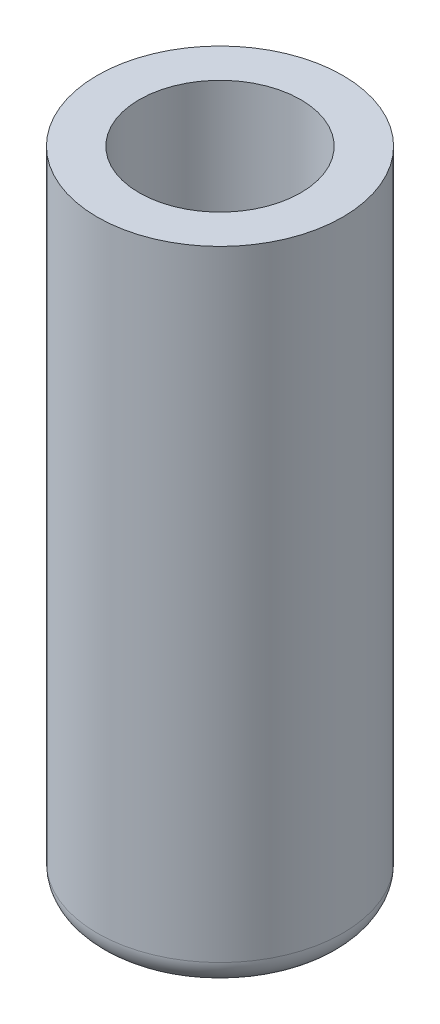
from build123d import *

# Parameters (mm, degrees)
SKETCH1_R          = 2.413
BASE_EXTRUDE_DEPTH = 6.35
SKETCH2_R          = 1.5875
CUT_EXTRUDE1_DEPTH = 14.150480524
FILLET1_R          = 0.508


with BuildPart() as part:
    # Sketch1 → Base-Extrude (new, symmetric)
    with BuildSketch(Plane(origin=(0, 0, 0), x_dir=(1, 0, 0), z_dir=(0, 1, 0))):
        with Locations(Location((0, 0, 0), (0, 0, 270))):
            Circle(SKETCH1_R)
    extrude(amount=BASE_EXTRUDE_DEPTH, both=True)

    # Sketch2 → Cut-Extrude1 (cut, through all)
    with BuildSketch(Plane(origin=(0, 6.35, 0), x_dir=(-1, 0, 0), z_dir=(0, 1, 0))):
        with Locations(Location((0, 0, 0), (0, 0, 90))):
            Circle(SKETCH2_R)
    extrude(amount=-CUT_EXTRUDE1_DEPTH, mode=Mode.SUBTRACT)

    # Fillet1
    fillet1_edges = [part.edges().sort_by_distance(p)[0] for p in [
        (0, -6.35, -2.413),
    ]]
    fillet(fillet1_edges, radius=FILLET1_R)


solid = part.part
